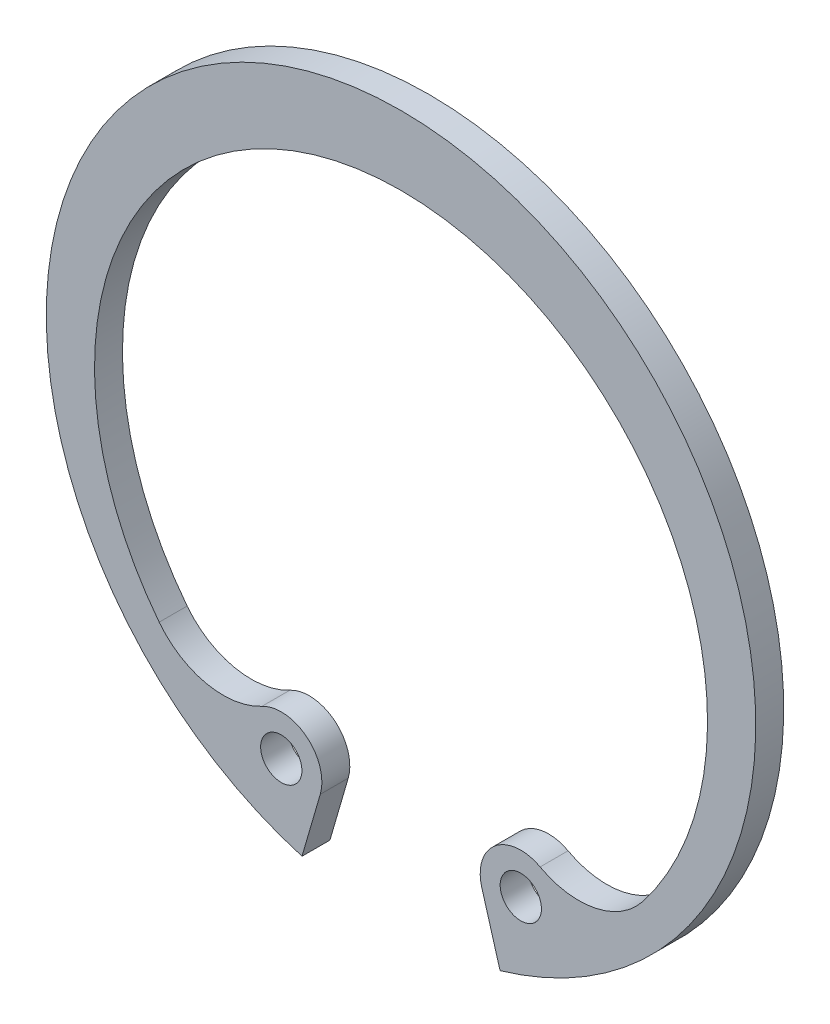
from build123d import *

# Parameters (mm, degrees)
BODYSKE_R  = 0.7874
BODY_DEPTH = 1.0668


with BuildPart() as part:
    # BodySke → Body (new body)
    with BuildSketch(Plane.XY):
        with BuildLine():
            Line((3.779336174, -12.999979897), (3.082614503, -10.603430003))
            ThreePointArc((3.082614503, -10.603430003), (3.597869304, -8.964750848), (5.308535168, -8.808612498))
            ThreePointArc((5.308535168, -8.808612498), (7.419639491, -9.117109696), (9.229795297, -7.987832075))
            ThreePointArc((9.229795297, -7.987832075), (0, 10.8966), (-9.229795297, -7.987832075))
            ThreePointArc((-9.229795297, -7.987832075), (-7.419639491, -9.117109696), (-5.308535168, -8.808612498))
            ThreePointArc((-5.308535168, -8.808612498), (-3.597869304, -8.964750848), (-3.082614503, -10.603430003))
            Line((-3.082614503, -10.603430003), (-3.779336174, -12.999979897))
            ThreePointArc((-3.779336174, -12.999979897), (0, 13.5382), (3.779336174, -12.999979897))
        make_face()
        with Locations((4.570417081, -10.170898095)):
            Circle(BODYSKE_R, mode=Mode.SUBTRACT)
        with Locations((-4.570417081, -10.170898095)):
            Circle(BODYSKE_R, mode=Mode.SUBTRACT)
    extrude(amount=-BODY_DEPTH)


solid = part.part
